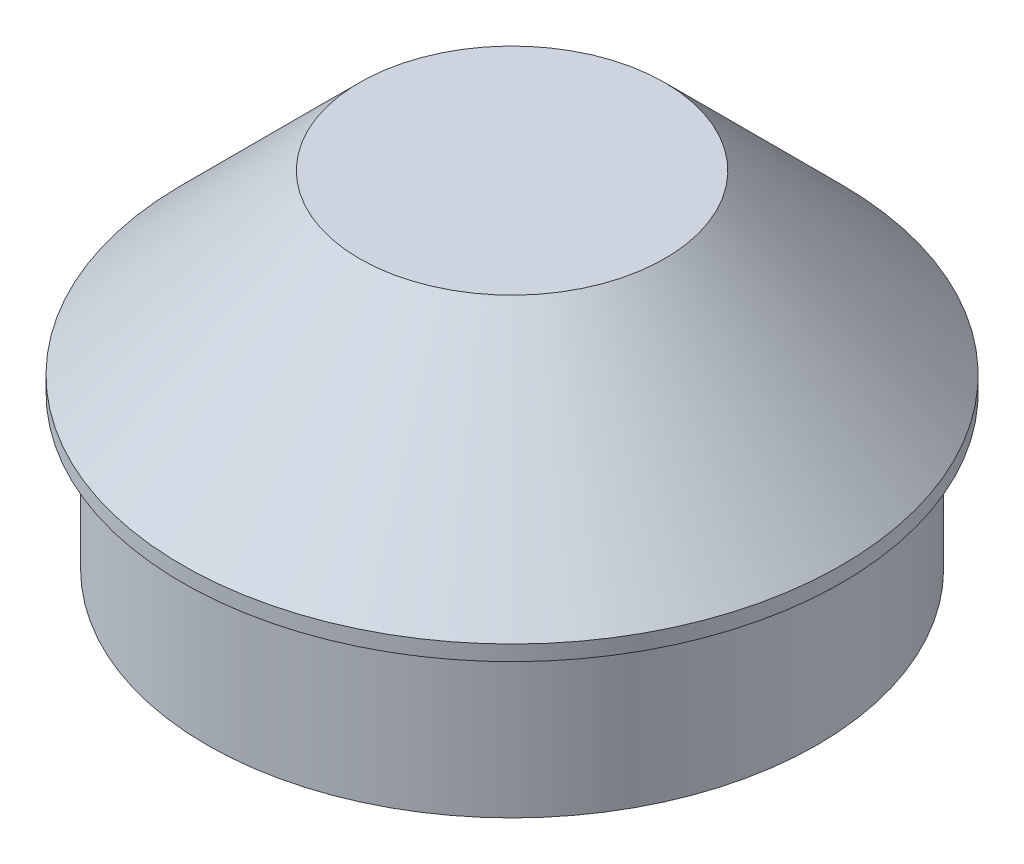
from build123d import *


with BuildPart() as part:
    # Sketch1 → Revolve1 (revolve)
    with BuildSketch(Plane.XY, mode=Mode.PRIVATE) as revolve1_sk:
        Polygon((-12.7, 28.702), (-27.432, 13.97), (-27.432, 12.7), (-25.4, 12.7), (-25.4, 0), (0, 0), (0, 28.702), align=None)
    revolve(revolve1_sk.sketch.rotate(Axis((0, 0, 0), (0, 1, 0)), 270), axis=Axis((0, 0, 0), (0, 1, 0)))


solid = part.part
